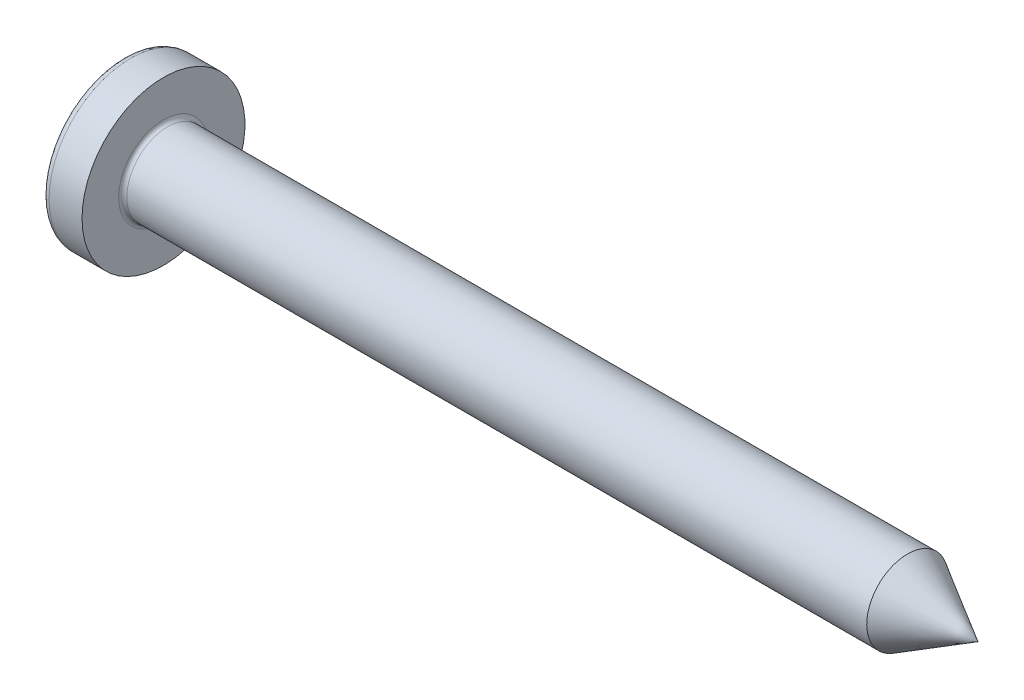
from build123d import *

# Parameters (mm, degrees)
FILLET1_R        = 0.1
RECPAT_COUNT     = 2
RECPAT_ANGLE     = 90
CHANFREIN1_SIZE  = 1
CHANFREIN1_SIZE2 = 1.732050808


with BuildPart() as part:
    # BodySke → Base-Revolve (revolve)
    with BuildSketch(Plane.XY, mode=Mode.PRIVATE) as base_revolve_sk:
        with BuildLine():
            Line((1.6, 1), (1.6, 2))
            Line((1.6, 2), (0.790020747, 2))
            ThreePointArc((0.790020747, 2), (0.709789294, 1.981130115), (0.646379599, 1.928476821))
            ThreePointArc((0.646379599, 1.928476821), (0.165895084, 1.016959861), (0, 0))
            Line((0, 0), (21.6, 0))
            Line((21.6, 0), (21.6, 1))
            Line((21.6, 1), (1.6, 1))
        make_face()
    revolve(base_revolve_sk.sketch.rotate(Axis((0.790020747, 0, 0), (1, 0, 0)), 90), axis=Axis((0.790020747, 0, 0), (1, 0, 0)))

    # Fillet1
    fillet1_edges = [part.edges().sort_by_distance(p)[0] for p in [
        (1.6, 0, -1),
    ]]
    fillet(fillet1_edges, radius=FILLET1_R)

    # Sketch3 → Recess section 0
    with BuildSketch(Plane(origin=(0, 0, 0), x_dir=(0, 0, -1), z_dir=(1, 0, 0))):
        with BuildLine():
            Line((0.24, -1.05), (-0.24, -1.05))
            Line((-0.24, -1.05), (-0.24, 1.05))
            Line((-0.24, 1.05), (0.24, 1.05))
            Line((0.24, 1.05), (0.24, -1.05))
        make_face()
    # Sketch4 → Recess section 1
    with BuildSketch(Plane(origin=(1.42, 0, 0), x_dir=(0, 0, -1), z_dir=(1, 0, 0))):
        with BuildLine():
            Line((0.24, -0.342014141), (-0.24, -0.342014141))
            Line((-0.24, -0.342014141), (-0.24, 0.342014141))
            Line((-0.24, 0.342014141), (0.24, 0.342014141))
            Line((0.24, 0.342014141), (0.24, -0.342014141))
        make_face()
    recess = loft(mode=Mode.SUBTRACT)

    # RecPat: Recess ×2 about axis
    recpat_axis = Axis((0, 0, 0), (1, 0, 0))
    for i in range(1, RECPAT_COUNT):
        add(recess.rotate(recpat_axis, i * RECPAT_ANGLE / (RECPAT_COUNT - 1)), mode=Mode.SUBTRACT)

    # RecCorSke → RecessCore (revolve, cut)
    with BuildSketch(Plane.XY, mode=Mode.PRIVATE) as recesscore_sk:
        Polygon((0, 0), (0, 0.454796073), (1.42, 0.3555), (1.535508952, 0), align=None)
    revolve(recesscore_sk.sketch.rotate(Axis((-3.175, 0, 0), (1, 0, 0)), 13.894577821), axis=Axis((-3.175, 0, 0), (1, 0, 0)), mode=Mode.SUBTRACT)

    # Chanfrein1
    chanfrein1_edges = [part.edges().sort_by_distance(p)[0] for p in [
        (21.6, 0, -1),
    ]]
    chanfrein1_side = [part.faces().sort_by_distance(p)[0] for p in [
        (21.6, 0, 0),
    ]]
    chamfer(chanfrein1_edges, length=CHANFREIN1_SIZE, length2=CHANFREIN1_SIZE2, reference=chanfrein1_side[0])


solid = part.part
